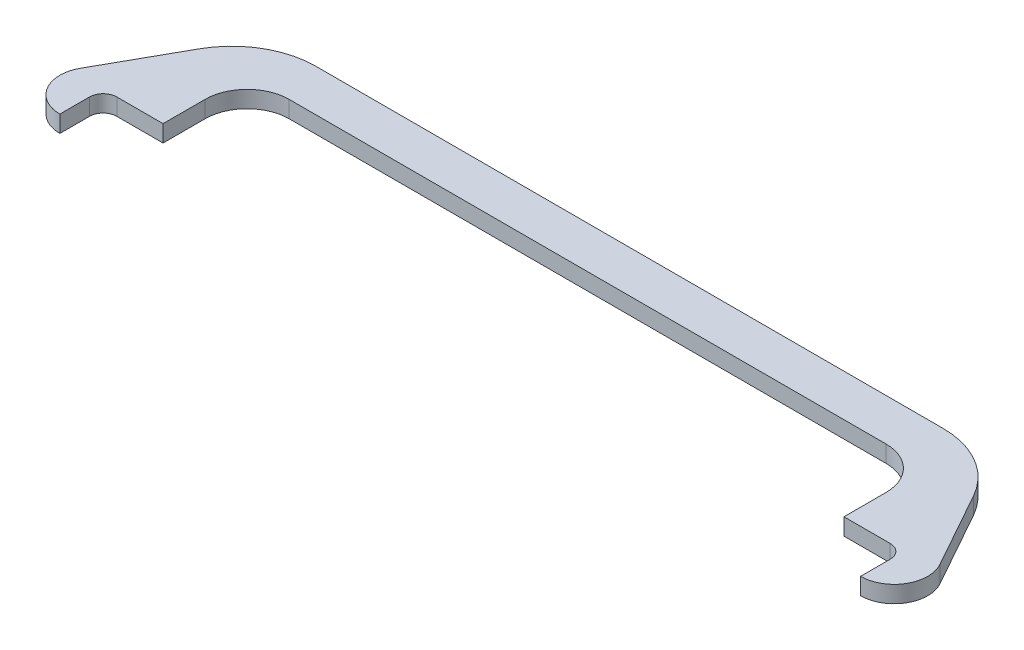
ISO-10303-21;
HEADER;
FILE_DESCRIPTION(('STEP AP214'),'2;1');
FILE_NAME('part.step','',(''),(''),'','','');
FILE_SCHEMA(('AUTOMOTIVE_DESIGN { 1 0 10303 214 1 1 1 1 }'));
ENDSEC;
DATA;
#1=APPLICATION_CONTEXT('core data for automotive mechanical design processes');
#2=APPLICATION_PROTOCOL_DEFINITION('international standard','automotive_design',2000,#1);
#3=PRODUCT_CONTEXT('',#1,'mechanical');
#4=PRODUCT('Part','Part','',(#3));
#5=PRODUCT_RELATED_PRODUCT_CATEGORY('part','',(#4));
#6=PRODUCT_DEFINITION_FORMATION('','',#4);
#7=PRODUCT_DEFINITION_CONTEXT('part definition',#1,'design');
#8=PRODUCT_DEFINITION('design','',#6,#7);
#9=PRODUCT_DEFINITION_SHAPE('','',#8);
#10=(LENGTH_UNIT() NAMED_UNIT(*) SI_UNIT(.MILLI.,.METRE.));
#11=(NAMED_UNIT(*) PLANE_ANGLE_UNIT() SI_UNIT($,.RADIAN.));
#12=(NAMED_UNIT(*) SI_UNIT($,.STERADIAN.) SOLID_ANGLE_UNIT());
#13=UNCERTAINTY_MEASURE_WITH_UNIT(LENGTH_MEASURE(1.E-05),#10,'distance_accuracy_value','');
#14=(GEOMETRIC_REPRESENTATION_CONTEXT(3) GLOBAL_UNCERTAINTY_ASSIGNED_CONTEXT((#13)) GLOBAL_UNIT_ASSIGNED_CONTEXT((#10,
#11,#12)) REPRESENTATION_CONTEXT('',''));
#15=CARTESIAN_POINT('',(0.,0.,0.));
#16=DIRECTION('',(0.,0.,1.));
#17=DIRECTION('',(1.,0.,0.));
#18=AXIS2_PLACEMENT_3D('',#15,#16,#17);
#19=CARTESIAN_POINT('',(149.257661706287,8.,20.));
#20=DIRECTION('',(0.,-1.,0.));
#21=DIRECTION('',(0.,0.,-1.));
#22=AXIS2_PLACEMENT_3D('',#19,#20,#21);
#23=CYLINDRICAL_SURFACE('',#22,40.);
#24=CARTESIAN_POINT('',(149.257661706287,0.,20.));
#25=DIRECTION('',(0.,1.,0.));
#26=DIRECTION('',(0.,0.,1.));
#27=AXIS2_PLACEMENT_3D('',#24,#25,#26);
#28=CIRCLE('',#27,40.);
#29=CARTESIAN_POINT('',(184.174544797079,0.,0.48561363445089));
#30=VERTEX_POINT('',#29);
#31=CARTESIAN_POINT('',(149.257661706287,0.,-20.));
#32=VERTEX_POINT('',#31);
#33=EDGE_CURVE('E158',#30,#32,#28,.T.);
#34=ORIENTED_EDGE('',*,*,#33,.T.);
#35=DIRECTION('',(0.,-1.,0.));
#36=VECTOR('',#35,1.);
#37=CARTESIAN_POINT('',(149.257661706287,8.,-20.));
#38=LINE('',#37,#36);
#39=CARTESIAN_POINT('',(149.257661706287,8.,-20.));
#40=VERTEX_POINT('',#39);
#41=EDGE_CURVE('E11',#40,#32,#38,.T.);
#42=ORIENTED_EDGE('',*,*,#41,.F.);
#43=CARTESIAN_POINT('',(149.257661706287,8.,20.));
#44=DIRECTION('',(0.,1.,0.));
#45=DIRECTION('',(0.,0.,1.));
#46=AXIS2_PLACEMENT_3D('',#43,#44,#45);
#47=CIRCLE('',#46,40.);
#48=CARTESIAN_POINT('',(184.174544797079,8.,0.48561363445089));
#49=VERTEX_POINT('',#48);
#50=EDGE_CURVE('E205',#49,#40,#47,.T.);
#51=ORIENTED_EDGE('',*,*,#50,.F.);
#52=DIRECTION('',(0.,-1.,0.));
#53=VECTOR('',#52,1.);
#54=CARTESIAN_POINT('',(184.174544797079,8.,0.48561363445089));
#55=LINE('',#54,#53);
#56=EDGE_CURVE('E171',#49,#30,#55,.T.);
#57=ORIENTED_EDGE('',*,*,#56,.T.);
#58=EDGE_LOOP('',(#34,#42,#51,#57));
#59=FACE_BOUND('',#58,.T.);
#60=ADVANCED_FACE('F30',(#59),#23,.T.);
#61=CARTESIAN_POINT('',(149.257661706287,8.,-20.));
#62=DIRECTION('',(0.,0.,1.));
#63=DIRECTION('',(1.,0.,0.));
#64=AXIS2_PLACEMENT_3D('',#61,#62,#63);
#65=PLANE('',#64);
#66=DIRECTION('',(-1.,0.,0.));
#67=VECTOR('',#66,1.);
#68=CARTESIAN_POINT('',(149.257661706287,0.,-20.));
#69=LINE('',#68,#67);
#70=CARTESIAN_POINT('',(-149.257661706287,0.,-20.));
#71=VERTEX_POINT('',#70);
#72=EDGE_CURVE('E154',#32,#71,#69,.T.);
#73=ORIENTED_EDGE('',*,*,#72,.T.);
#74=DIRECTION('',(0.,-1.,0.));
#75=VECTOR('',#74,1.);
#76=CARTESIAN_POINT('',(-149.257661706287,8.,-20.));
#77=LINE('',#76,#75);
#78=CARTESIAN_POINT('',(-149.257661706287,8.,-20.));
#79=VERTEX_POINT('',#78);
#80=EDGE_CURVE('E37',#79,#71,#77,.T.);
#81=ORIENTED_EDGE('',*,*,#80,.F.);
#82=DIRECTION('',(-1.,0.,0.));
#83=VECTOR('',#82,1.);
#84=CARTESIAN_POINT('',(149.257661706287,8.,-20.));
#85=LINE('',#84,#83);
#86=EDGE_CURVE('E167',#40,#79,#85,.T.);
#87=ORIENTED_EDGE('',*,*,#86,.F.);
#88=ORIENTED_EDGE('',*,*,#41,.T.);
#89=EDGE_LOOP('',(#73,#81,#87,#88));
#90=FACE_BOUND('',#89,.T.);
#91=ADVANCED_FACE('F166',(#90),#65,.F.);
#92=CARTESIAN_POINT('',(-149.257661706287,8.,20.));
#93=DIRECTION('',(0.,-1.,0.));
#94=DIRECTION('',(0.,0.,-1.));
#95=AXIS2_PLACEMENT_3D('',#92,#93,#94);
#96=CYLINDRICAL_SURFACE('',#95,40.);
#97=CARTESIAN_POINT('',(-149.257661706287,0.,20.));
#98=DIRECTION('',(0.,1.,0.));
#99=DIRECTION('',(0.,0.,-1.));
#100=AXIS2_PLACEMENT_3D('',#97,#98,#99);
#101=CIRCLE('',#100,40.);
#102=CARTESIAN_POINT('',(-184.174544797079,0.,0.48561363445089));
#103=VERTEX_POINT('',#102);
#104=EDGE_CURVE('E160',#71,#103,#101,.T.);
#105=ORIENTED_EDGE('',*,*,#104,.T.);
#106=DIRECTION('',(0.,-1.,0.));
#107=VECTOR('',#106,1.);
#108=CARTESIAN_POINT('',(-184.174544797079,8.,0.48561363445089));
#109=LINE('',#108,#107);
#110=CARTESIAN_POINT('',(-184.174544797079,8.,0.48561363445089));
#111=VERTEX_POINT('',#110);
#112=EDGE_CURVE('E281',#111,#103,#109,.T.);
#113=ORIENTED_EDGE('',*,*,#112,.F.);
#114=CARTESIAN_POINT('',(-149.257661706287,8.,20.));
#115=DIRECTION('',(0.,1.,0.));
#116=DIRECTION('',(0.,0.,-1.));
#117=AXIS2_PLACEMENT_3D('',#114,#115,#116);
#118=CIRCLE('',#117,40.);
#119=EDGE_CURVE('E208',#79,#111,#118,.T.);
#120=ORIENTED_EDGE('',*,*,#119,.F.);
#121=ORIENTED_EDGE('',*,*,#80,.T.);
#122=EDGE_LOOP('',(#105,#113,#120,#121));
#123=FACE_BOUND('',#122,.T.);
#124=ADVANCED_FACE('F285',(#123),#96,.T.);
#125=CARTESIAN_POINT('',(-204.466753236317,8.,36.7942454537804));
#126=DIRECTION('',(0.872922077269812,0.,0.487859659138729));
#127=DIRECTION('',(0.487859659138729,0.,-0.872922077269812));
#128=AXIS2_PLACEMENT_3D('',#125,#126,#127);
#129=PLANE('',#128);
#130=DIRECTION('',(-0.487859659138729,0.,0.872922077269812));
#131=VECTOR('',#130,1.);
#132=CARTESIAN_POINT('',(-204.466753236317,0.,36.7942454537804));
#133=LINE('',#132,#131);
#134=CARTESIAN_POINT('',(-204.466753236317,0.,36.7942454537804));
#135=VERTEX_POINT('',#134);
#136=EDGE_CURVE('E175',#103,#135,#133,.T.);
#137=ORIENTED_EDGE('',*,*,#136,.T.);
#138=DIRECTION('',(0.,-1.,0.));
#139=VECTOR('',#138,1.);
#140=CARTESIAN_POINT('',(-204.466753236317,8.,36.7942454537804));
#141=LINE('',#140,#139);
#142=CARTESIAN_POINT('',(-204.466753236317,8.,36.7942454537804));
#143=VERTEX_POINT('',#142);
#144=EDGE_CURVE('E278',#143,#135,#141,.T.);
#145=ORIENTED_EDGE('',*,*,#144,.F.);
#146=DIRECTION('',(-0.487859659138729,0.,0.872922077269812));
#147=VECTOR('',#146,1.);
#148=CARTESIAN_POINT('',(-204.466753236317,8.,36.7942454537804));
#149=LINE('',#148,#147);
#150=EDGE_CURVE('E210',#111,#143,#149,.T.);
#151=ORIENTED_EDGE('',*,*,#150,.F.);
#152=ORIENTED_EDGE('',*,*,#112,.T.);
#153=EDGE_LOOP('',(#137,#145,#151,#152));
#154=FACE_BOUND('',#153,.T.);
#155=ADVANCED_FACE('F293',(#154),#129,.F.);
#156=CARTESIAN_POINT('',(-190.5,8.,44.6));
#157=DIRECTION('',(0.,-1.,0.));
#158=DIRECTION('',(0.,0.,-1.));
#159=AXIS2_PLACEMENT_3D('',#156,#157,#158);
#160=CYLINDRICAL_SURFACE('',#159,16.);
#161=CARTESIAN_POINT('',(-190.5,0.,44.6));
#162=DIRECTION('',(0.,1.,0.));
#163=DIRECTION('',(0.,0.,-1.));
#164=AXIS2_PLACEMENT_3D('',#161,#162,#163);
#165=CIRCLE('',#164,16.);
#166=CARTESIAN_POINT('',(-190.5,0.,60.6));
#167=VERTEX_POINT('',#166);
#168=EDGE_CURVE('E177',#135,#167,#165,.T.);
#169=ORIENTED_EDGE('',*,*,#168,.T.);
#170=DIRECTION('',(0.,-1.,0.));
#171=VECTOR('',#170,1.);
#172=CARTESIAN_POINT('',(-190.5,8.,60.6));
#173=LINE('',#172,#171);
#174=CARTESIAN_POINT('',(-190.5,8.,60.6));
#175=VERTEX_POINT('',#174);
#176=EDGE_CURVE('E275',#175,#167,#173,.T.);
#177=ORIENTED_EDGE('',*,*,#176,.F.);
#178=CARTESIAN_POINT('',(-190.5,8.,44.6));
#179=DIRECTION('',(0.,1.,0.));
#180=DIRECTION('',(0.,0.,-1.));
#181=AXIS2_PLACEMENT_3D('',#178,#179,#180);
#182=CIRCLE('',#181,16.);
#183=EDGE_CURVE('E212',#143,#175,#182,.T.);
#184=ORIENTED_EDGE('',*,*,#183,.F.);
#185=ORIENTED_EDGE('',*,*,#144,.T.);
#186=EDGE_LOOP('',(#169,#177,#184,#185));
#187=FACE_BOUND('',#186,.T.);
#188=ADVANCED_FACE('F296',(#187),#160,.T.);
#189=CARTESIAN_POINT('',(-190.5,8.,46.5));
#190=DIRECTION('',(-1.,0.,0.));
#191=DIRECTION('',(0.,0.,1.));
#192=AXIS2_PLACEMENT_3D('',#189,#190,#191);
#193=PLANE('',#192);
#194=DIRECTION('',(0.,0.,-1.));
#195=VECTOR('',#194,1.);
#196=CARTESIAN_POINT('',(-190.5,0.,46.5));
#197=LINE('',#196,#195);
#198=CARTESIAN_POINT('',(-190.5,0.,46.5));
#199=VERTEX_POINT('',#198);
#200=EDGE_CURVE('E179',#167,#199,#197,.T.);
#201=ORIENTED_EDGE('',*,*,#200,.T.);
#202=DIRECTION('',(0.,-1.,0.));
#203=VECTOR('',#202,1.);
#204=CARTESIAN_POINT('',(-190.5,8.,46.5));
#205=LINE('',#204,#203);
#206=CARTESIAN_POINT('',(-190.5,8.,46.5));
#207=VERTEX_POINT('',#206);
#208=EDGE_CURVE('E272',#207,#199,#205,.T.);
#209=ORIENTED_EDGE('',*,*,#208,.F.);
#210=DIRECTION('',(0.,0.,-1.));
#211=VECTOR('',#210,1.);
#212=CARTESIAN_POINT('',(-190.5,8.,46.5));
#213=LINE('',#212,#211);
#214=EDGE_CURVE('E214',#175,#207,#213,.T.);
#215=ORIENTED_EDGE('',*,*,#214,.F.);
#216=ORIENTED_EDGE('',*,*,#176,.T.);
#217=EDGE_LOOP('',(#201,#209,#215,#216));
#218=FACE_BOUND('',#217,.T.);
#219=ADVANCED_FACE('F301',(#218),#193,.F.);
#220=CARTESIAN_POINT('',(-184.,8.,46.5));
#221=DIRECTION('',(0.,-1.,0.));
#222=DIRECTION('',(0.,0.,-1.));
#223=AXIS2_PLACEMENT_3D('',#220,#221,#222);
#224=CYLINDRICAL_SURFACE('',#223,6.5);
#225=CARTESIAN_POINT('',(-184.,0.,46.5));
#226=DIRECTION('',(0.,-1.,0.));
#227=DIRECTION('',(0.,0.,-1.));
#228=AXIS2_PLACEMENT_3D('',#225,#226,#227);
#229=CIRCLE('',#228,6.5);
#230=CARTESIAN_POINT('',(-184.,0.,40.));
#231=VERTEX_POINT('',#230);
#232=EDGE_CURVE('E181',#199,#231,#229,.T.);
#233=ORIENTED_EDGE('',*,*,#232,.T.);
#234=DIRECTION('',(0.,-1.,0.));
#235=VECTOR('',#234,1.);
#236=CARTESIAN_POINT('',(-184.,8.,40.));
#237=LINE('',#236,#235);
#238=CARTESIAN_POINT('',(-184.,8.,40.));
#239=VERTEX_POINT('',#238);
#240=EDGE_CURVE('E269',#239,#231,#237,.T.);
#241=ORIENTED_EDGE('',*,*,#240,.F.);
#242=CARTESIAN_POINT('',(-184.,8.,46.5));
#243=DIRECTION('',(0.,-1.,0.));
#244=DIRECTION('',(0.,0.,-1.));
#245=AXIS2_PLACEMENT_3D('',#242,#243,#244);
#246=CIRCLE('',#245,6.5);
#247=EDGE_CURVE('E216',#207,#239,#246,.T.);
#248=ORIENTED_EDGE('',*,*,#247,.F.);
#249=ORIENTED_EDGE('',*,*,#208,.T.);
#250=EDGE_LOOP('',(#233,#241,#248,#249));
#251=FACE_BOUND('',#250,.T.);
#252=ADVANCED_FACE('F307',(#251),#224,.F.);
#253=CARTESIAN_POINT('',(-162.,8.,40.));
#254=DIRECTION('',(0.,0.,-1.));
#255=DIRECTION('',(-1.,0.,0.));
#256=AXIS2_PLACEMENT_3D('',#253,#254,#255);
#257=PLANE('',#256);
#258=DIRECTION('',(1.,0.,0.));
#259=VECTOR('',#258,1.);
#260=CARTESIAN_POINT('',(-162.,0.,40.));
#261=LINE('',#260,#259);
#262=CARTESIAN_POINT('',(-162.,0.,40.));
#263=VERTEX_POINT('',#262);
#264=EDGE_CURVE('E183',#231,#263,#261,.T.);
#265=ORIENTED_EDGE('',*,*,#264,.T.);
#266=DIRECTION('',(0.,-1.,0.));
#267=VECTOR('',#266,1.);
#268=CARTESIAN_POINT('',(-162.,8.,40.));
#269=LINE('',#268,#267);
#270=CARTESIAN_POINT('',(-162.,8.,40.));
#271=VERTEX_POINT('',#270);
#272=EDGE_CURVE('E266',#271,#263,#269,.T.);
#273=ORIENTED_EDGE('',*,*,#272,.F.);
#274=DIRECTION('',(1.,0.,0.));
#275=VECTOR('',#274,1.);
#276=CARTESIAN_POINT('',(-162.,8.,40.));
#277=LINE('',#276,#275);
#278=EDGE_CURVE('E218',#239,#271,#277,.T.);
#279=ORIENTED_EDGE('',*,*,#278,.F.);
#280=ORIENTED_EDGE('',*,*,#240,.T.);
#281=EDGE_LOOP('',(#265,#273,#279,#280));
#282=FACE_BOUND('',#281,.T.);
#283=ADVANCED_FACE('F311',(#282),#257,.F.);
#284=CARTESIAN_POINT('',(-162.,8.,20.0000000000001));
#285=DIRECTION('',(-1.,0.,0.));
#286=DIRECTION('',(0.,0.,1.));
#287=AXIS2_PLACEMENT_3D('',#284,#285,#286);
#288=PLANE('',#287);
#289=DIRECTION('',(0.,0.,-1.));
#290=VECTOR('',#289,1.);
#291=CARTESIAN_POINT('',(-162.,0.,20.0000000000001));
#292=LINE('',#291,#290);
#293=CARTESIAN_POINT('',(-162.,0.,20.0000000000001));
#294=VERTEX_POINT('',#293);
#295=EDGE_CURVE('E185',#263,#294,#292,.T.);
#296=ORIENTED_EDGE('',*,*,#295,.T.);
#297=DIRECTION('',(0.,-1.,0.));
#298=VECTOR('',#297,1.);
#299=CARTESIAN_POINT('',(-162.,8.,20.0000000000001));
#300=LINE('',#299,#298);
#301=CARTESIAN_POINT('',(-162.,8.,20.0000000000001));
#302=VERTEX_POINT('',#301);
#303=EDGE_CURVE('E263',#302,#294,#300,.T.);
#304=ORIENTED_EDGE('',*,*,#303,.F.);
#305=DIRECTION('',(0.,0.,-1.));
#306=VECTOR('',#305,1.);
#307=CARTESIAN_POINT('',(-162.,8.,20.0000000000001));
#308=LINE('',#307,#306);
#309=EDGE_CURVE('E220',#271,#302,#308,.T.);
#310=ORIENTED_EDGE('',*,*,#309,.F.);
#311=ORIENTED_EDGE('',*,*,#272,.T.);
#312=EDGE_LOOP('',(#296,#304,#310,#311));
#313=FACE_BOUND('',#312,.T.);
#314=ADVANCED_FACE('F316',(#313),#288,.F.);
#315=CARTESIAN_POINT('',(-142.,8.,20.));
#316=DIRECTION('',(0.,-1.,0.));
#317=DIRECTION('',(0.,0.,-1.));
#318=AXIS2_PLACEMENT_3D('',#315,#316,#317);
#319=CYLINDRICAL_SURFACE('',#318,20.);
#320=CARTESIAN_POINT('',(-142.,0.,20.));
#321=DIRECTION('',(0.,-1.,0.));
#322=DIRECTION('',(0.,0.,-1.));
#323=AXIS2_PLACEMENT_3D('',#320,#321,#322);
#324=CIRCLE('',#323,20.);
#325=CARTESIAN_POINT('',(-142.,0.,0.));
#326=VERTEX_POINT('',#325);
#327=EDGE_CURVE('E187',#294,#326,#324,.T.);
#328=ORIENTED_EDGE('',*,*,#327,.T.);
#329=DIRECTION('',(0.,-1.,0.));
#330=VECTOR('',#329,1.);
#331=CARTESIAN_POINT('',(-142.,8.,0.));
#332=LINE('',#331,#330);
#333=CARTESIAN_POINT('',(-142.,8.,0.));
#334=VERTEX_POINT('',#333);
#335=EDGE_CURVE('E260',#334,#326,#332,.T.);
#336=ORIENTED_EDGE('',*,*,#335,.F.);
#337=CARTESIAN_POINT('',(-142.,8.,20.));
#338=DIRECTION('',(0.,-1.,0.));
#339=DIRECTION('',(0.,0.,-1.));
#340=AXIS2_PLACEMENT_3D('',#337,#338,#339);
#341=CIRCLE('',#340,20.);
#342=EDGE_CURVE('E222',#302,#334,#341,.T.);
#343=ORIENTED_EDGE('',*,*,#342,.F.);
#344=ORIENTED_EDGE('',*,*,#303,.T.);
#345=EDGE_LOOP('',(#328,#336,#343,#344));
#346=FACE_BOUND('',#345,.T.);
#347=ADVANCED_FACE('F322',(#346),#319,.F.);
#348=CARTESIAN_POINT('',(-142.,8.,0.));
#349=DIRECTION('',(0.,0.,-1.));
#350=DIRECTION('',(-1.,0.,0.));
#351=AXIS2_PLACEMENT_3D('',#348,#349,#350);
#352=PLANE('',#351);
#353=DIRECTION('',(1.,0.,0.));
#354=VECTOR('',#353,1.);
#355=CARTESIAN_POINT('',(-142.,0.,0.));
#356=LINE('',#355,#354);
#357=CARTESIAN_POINT('',(142.,0.,0.));
#358=VERTEX_POINT('',#357);
#359=EDGE_CURVE('E189',#326,#358,#356,.T.);
#360=ORIENTED_EDGE('',*,*,#359,.T.);
#361=DIRECTION('',(0.,-1.,0.));
#362=VECTOR('',#361,1.);
#363=CARTESIAN_POINT('',(142.,8.,0.));
#364=LINE('',#363,#362);
#365=CARTESIAN_POINT('',(142.,8.,0.));
#366=VERTEX_POINT('',#365);
#367=EDGE_CURVE('E257',#366,#358,#364,.T.);
#368=ORIENTED_EDGE('',*,*,#367,.F.);
#369=DIRECTION('',(1.,0.,0.));
#370=VECTOR('',#369,1.);
#371=CARTESIAN_POINT('',(-142.,8.,0.));
#372=LINE('',#371,#370);
#373=EDGE_CURVE('E224',#334,#366,#372,.T.);
#374=ORIENTED_EDGE('',*,*,#373,.F.);
#375=ORIENTED_EDGE('',*,*,#335,.T.);
#376=EDGE_LOOP('',(#360,#368,#374,#375));
#377=FACE_BOUND('',#376,.T.);
#378=ADVANCED_FACE('F326',(#377),#352,.F.);
#379=CARTESIAN_POINT('',(142.,8.,20.));
#380=DIRECTION('',(0.,-1.,0.));
#381=DIRECTION('',(0.,0.,-1.));
#382=AXIS2_PLACEMENT_3D('',#379,#380,#381);
#383=CYLINDRICAL_SURFACE('',#382,20.);
#384=CARTESIAN_POINT('',(142.,0.,20.));
#385=DIRECTION('',(0.,-1.,0.));
#386=DIRECTION('',(0.,0.,1.));
#387=AXIS2_PLACEMENT_3D('',#384,#385,#386);
#388=CIRCLE('',#387,20.);
#389=CARTESIAN_POINT('',(162.,0.,20.0000000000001));
#390=VERTEX_POINT('',#389);
#391=EDGE_CURVE('E191',#358,#390,#388,.T.);
#392=ORIENTED_EDGE('',*,*,#391,.T.);
#393=DIRECTION('',(0.,-1.,0.));
#394=VECTOR('',#393,1.);
#395=CARTESIAN_POINT('',(162.,8.,20.0000000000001));
#396=LINE('',#395,#394);
#397=CARTESIAN_POINT('',(162.,8.,20.0000000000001));
#398=VERTEX_POINT('',#397);
#399=EDGE_CURVE('E254',#398,#390,#396,.T.);
#400=ORIENTED_EDGE('',*,*,#399,.F.);
#401=CARTESIAN_POINT('',(142.,8.,20.));
#402=DIRECTION('',(0.,-1.,0.));
#403=DIRECTION('',(0.,0.,1.));
#404=AXIS2_PLACEMENT_3D('',#401,#402,#403);
#405=CIRCLE('',#404,20.);
#406=EDGE_CURVE('E226',#366,#398,#405,.T.);
#407=ORIENTED_EDGE('',*,*,#406,.F.);
#408=ORIENTED_EDGE('',*,*,#367,.T.);
#409=EDGE_LOOP('',(#392,#400,#407,#408));
#410=FACE_BOUND('',#409,.T.);
#411=ADVANCED_FACE('F331',(#410),#383,.F.);
#412=CARTESIAN_POINT('',(162.,8.,20.0000000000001));
#413=DIRECTION('',(1.,0.,0.));
#414=DIRECTION('',(0.,0.,-1.));
#415=AXIS2_PLACEMENT_3D('',#412,#413,#414);
#416=PLANE('',#415);
#417=DIRECTION('',(0.,0.,1.));
#418=VECTOR('',#417,1.);
#419=CARTESIAN_POINT('',(162.,0.,20.0000000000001));
#420=LINE('',#419,#418);
#421=CARTESIAN_POINT('',(162.,0.,40.));
#422=VERTEX_POINT('',#421);
#423=EDGE_CURVE('E193',#390,#422,#420,.T.);
#424=ORIENTED_EDGE('',*,*,#423,.T.);
#425=DIRECTION('',(0.,-1.,0.));
#426=VECTOR('',#425,1.);
#427=CARTESIAN_POINT('',(162.,8.,40.));
#428=LINE('',#427,#426);
#429=CARTESIAN_POINT('',(162.,8.,40.));
#430=VERTEX_POINT('',#429);
#431=EDGE_CURVE('E251',#430,#422,#428,.T.);
#432=ORIENTED_EDGE('',*,*,#431,.F.);
#433=DIRECTION('',(0.,0.,1.));
#434=VECTOR('',#433,1.);
#435=CARTESIAN_POINT('',(162.,8.,20.0000000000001));
#436=LINE('',#435,#434);
#437=EDGE_CURVE('E228',#398,#430,#436,.T.);
#438=ORIENTED_EDGE('',*,*,#437,.F.);
#439=ORIENTED_EDGE('',*,*,#399,.T.);
#440=EDGE_LOOP('',(#424,#432,#438,#439));
#441=FACE_BOUND('',#440,.T.);
#442=ADVANCED_FACE('F337',(#441),#416,.F.);
#443=CARTESIAN_POINT('',(162.,8.,40.));
#444=DIRECTION('',(0.,0.,-1.));
#445=DIRECTION('',(-1.,0.,0.));
#446=AXIS2_PLACEMENT_3D('',#443,#444,#445);
#447=PLANE('',#446);
#448=DIRECTION('',(1.,0.,0.));
#449=VECTOR('',#448,1.);
#450=CARTESIAN_POINT('',(162.,0.,40.));
#451=LINE('',#450,#449);
#452=CARTESIAN_POINT('',(184.,0.,40.));
#453=VERTEX_POINT('',#452);
#454=EDGE_CURVE('E195',#422,#453,#451,.T.);
#455=ORIENTED_EDGE('',*,*,#454,.T.);
#456=DIRECTION('',(0.,-1.,0.));
#457=VECTOR('',#456,1.);
#458=CARTESIAN_POINT('',(184.,8.,40.));
#459=LINE('',#458,#457);
#460=CARTESIAN_POINT('',(184.,8.,40.));
#461=VERTEX_POINT('',#460);
#462=EDGE_CURVE('E248',#461,#453,#459,.T.);
#463=ORIENTED_EDGE('',*,*,#462,.F.);
#464=DIRECTION('',(1.,0.,0.));
#465=VECTOR('',#464,1.);
#466=CARTESIAN_POINT('',(162.,8.,40.));
#467=LINE('',#466,#465);
#468=EDGE_CURVE('E230',#430,#461,#467,.T.);
#469=ORIENTED_EDGE('',*,*,#468,.F.);
#470=ORIENTED_EDGE('',*,*,#431,.T.);
#471=EDGE_LOOP('',(#455,#463,#469,#470));
#472=FACE_BOUND('',#471,.T.);
#473=ADVANCED_FACE('F341',(#472),#447,.F.);
#474=CARTESIAN_POINT('',(184.,8.,46.5));
#475=DIRECTION('',(0.,-1.,0.));
#476=DIRECTION('',(0.,0.,-1.));
#477=AXIS2_PLACEMENT_3D('',#474,#475,#476);
#478=CYLINDRICAL_SURFACE('',#477,6.5);
#479=CARTESIAN_POINT('',(184.,0.,46.5));
#480=DIRECTION('',(0.,-1.,0.));
#481=DIRECTION('',(0.,0.,1.));
#482=AXIS2_PLACEMENT_3D('',#479,#480,#481);
#483=CIRCLE('',#482,6.5);
#484=CARTESIAN_POINT('',(190.5,0.,46.5));
#485=VERTEX_POINT('',#484);
#486=EDGE_CURVE('E197',#453,#485,#483,.T.);
#487=ORIENTED_EDGE('',*,*,#486,.T.);
#488=DIRECTION('',(0.,-1.,0.));
#489=VECTOR('',#488,1.);
#490=CARTESIAN_POINT('',(190.5,8.,46.5));
#491=LINE('',#490,#489);
#492=CARTESIAN_POINT('',(190.5,8.,46.5));
#493=VERTEX_POINT('',#492);
#494=EDGE_CURVE('E245',#493,#485,#491,.T.);
#495=ORIENTED_EDGE('',*,*,#494,.F.);
#496=CARTESIAN_POINT('',(184.,8.,46.5));
#497=DIRECTION('',(0.,-1.,0.));
#498=DIRECTION('',(0.,0.,1.));
#499=AXIS2_PLACEMENT_3D('',#496,#497,#498);
#500=CIRCLE('',#499,6.5);
#501=EDGE_CURVE('E232',#461,#493,#500,.T.);
#502=ORIENTED_EDGE('',*,*,#501,.F.);
#503=ORIENTED_EDGE('',*,*,#462,.T.);
#504=EDGE_LOOP('',(#487,#495,#502,#503));
#505=FACE_BOUND('',#504,.T.);
#506=ADVANCED_FACE('F346',(#505),#478,.F.);
#507=CARTESIAN_POINT('',(190.5,8.,46.5));
#508=DIRECTION('',(1.,0.,0.));
#509=DIRECTION('',(0.,0.,-1.));
#510=AXIS2_PLACEMENT_3D('',#507,#508,#509);
#511=PLANE('',#510);
#512=DIRECTION('',(0.,0.,1.));
#513=VECTOR('',#512,1.);
#514=CARTESIAN_POINT('',(190.5,0.,46.5));
#515=LINE('',#514,#513);
#516=CARTESIAN_POINT('',(190.5,0.,60.6));
#517=VERTEX_POINT('',#516);
#518=EDGE_CURVE('E199',#485,#517,#515,.T.);
#519=ORIENTED_EDGE('',*,*,#518,.T.);
#520=DIRECTION('',(0.,-1.,0.));
#521=VECTOR('',#520,1.);
#522=CARTESIAN_POINT('',(190.5,8.,60.6));
#523=LINE('',#522,#521);
#524=CARTESIAN_POINT('',(190.5,8.,60.6));
#525=VERTEX_POINT('',#524);
#526=EDGE_CURVE('E242',#525,#517,#523,.T.);
#527=ORIENTED_EDGE('',*,*,#526,.F.);
#528=DIRECTION('',(0.,0.,1.));
#529=VECTOR('',#528,1.);
#530=CARTESIAN_POINT('',(190.5,8.,46.5));
#531=LINE('',#530,#529);
#532=EDGE_CURVE('E234',#493,#525,#531,.T.);
#533=ORIENTED_EDGE('',*,*,#532,.F.);
#534=ORIENTED_EDGE('',*,*,#494,.T.);
#535=EDGE_LOOP('',(#519,#527,#533,#534));
#536=FACE_BOUND('',#535,.T.);
#537=ADVANCED_FACE('F350',(#536),#511,.F.);
#538=CARTESIAN_POINT('',(190.5,8.,44.6));
#539=DIRECTION('',(0.,-1.,0.));
#540=DIRECTION('',(0.,0.,-1.));
#541=AXIS2_PLACEMENT_3D('',#538,#539,#540);
#542=CYLINDRICAL_SURFACE('',#541,16.);
#543=CARTESIAN_POINT('',(190.5,0.,44.6));
#544=DIRECTION('',(0.,1.,0.));
#545=DIRECTION('',(0.,0.,1.));
#546=AXIS2_PLACEMENT_3D('',#543,#544,#545);
#547=CIRCLE('',#546,16.);
#548=CARTESIAN_POINT('',(204.466753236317,0.,36.7942454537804));
#549=VERTEX_POINT('',#548);
#550=EDGE_CURVE('E201',#517,#549,#547,.T.);
#551=ORIENTED_EDGE('',*,*,#550,.T.);
#552=DIRECTION('',(0.,-1.,0.));
#553=VECTOR('',#552,1.);
#554=CARTESIAN_POINT('',(204.466753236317,8.,36.7942454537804));
#555=LINE('',#554,#553);
#556=CARTESIAN_POINT('',(204.466753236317,8.,36.7942454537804));
#557=VERTEX_POINT('',#556);
#558=EDGE_CURVE('E239',#557,#549,#555,.T.);
#559=ORIENTED_EDGE('',*,*,#558,.F.);
#560=CARTESIAN_POINT('',(190.5,8.,44.6));
#561=DIRECTION('',(0.,1.,0.));
#562=DIRECTION('',(0.,0.,1.));
#563=AXIS2_PLACEMENT_3D('',#560,#561,#562);
#564=CIRCLE('',#563,16.);
#565=EDGE_CURVE('E49',#525,#557,#564,.T.);
#566=ORIENTED_EDGE('',*,*,#565,.F.);
#567=ORIENTED_EDGE('',*,*,#526,.T.);
#568=EDGE_LOOP('',(#551,#559,#566,#567));
#569=FACE_BOUND('',#568,.T.);
#570=ADVANCED_FACE('F354',(#569),#542,.T.);
#571=CARTESIAN_POINT('',(204.466753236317,8.,36.7942454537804));
#572=DIRECTION('',(-0.872922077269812,0.,0.487859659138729));
#573=DIRECTION('',(0.487859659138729,0.,0.872922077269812));
#574=AXIS2_PLACEMENT_3D('',#571,#572,#573);
#575=PLANE('',#574);
#576=DIRECTION('',(-0.487859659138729,0.,-0.872922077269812));
#577=VECTOR('',#576,1.);
#578=CARTESIAN_POINT('',(204.466753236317,0.,36.7942454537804));
#579=LINE('',#578,#577);
#580=EDGE_CURVE('E203',#549,#30,#579,.T.);
#581=ORIENTED_EDGE('',*,*,#580,.T.);
#582=ORIENTED_EDGE('',*,*,#56,.F.);
#583=DIRECTION('',(-0.487859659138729,0.,-0.872922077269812));
#584=VECTOR('',#583,1.);
#585=CARTESIAN_POINT('',(204.466753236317,8.,36.7942454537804));
#586=LINE('',#585,#584);
#587=EDGE_CURVE('E44',#557,#49,#586,.T.);
#588=ORIENTED_EDGE('',*,*,#587,.F.);
#589=ORIENTED_EDGE('',*,*,#558,.T.);
#590=EDGE_LOOP('',(#581,#582,#588,#589));
#591=FACE_BOUND('',#590,.T.);
#592=ADVANCED_FACE('F356',(#591),#575,.F.);
#593=CARTESIAN_POINT('',(149.257661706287,8.,20.));
#594=DIRECTION('',(0.,1.,0.));
#595=DIRECTION('',(0.,0.,1.));
#596=AXIS2_PLACEMENT_3D('',#593,#594,#595);
#597=PLANE('',#596);
#598=ORIENTED_EDGE('',*,*,#50,.T.);
#599=ORIENTED_EDGE('',*,*,#86,.T.);
#600=ORIENTED_EDGE('',*,*,#119,.T.);
#601=ORIENTED_EDGE('',*,*,#150,.T.);
#602=ORIENTED_EDGE('',*,*,#183,.T.);
#603=ORIENTED_EDGE('',*,*,#214,.T.);
#604=ORIENTED_EDGE('',*,*,#247,.T.);
#605=ORIENTED_EDGE('',*,*,#278,.T.);
#606=ORIENTED_EDGE('',*,*,#309,.T.);
#607=ORIENTED_EDGE('',*,*,#342,.T.);
#608=ORIENTED_EDGE('',*,*,#373,.T.);
#609=ORIENTED_EDGE('',*,*,#406,.T.);
#610=ORIENTED_EDGE('',*,*,#437,.T.);
#611=ORIENTED_EDGE('',*,*,#468,.T.);
#612=ORIENTED_EDGE('',*,*,#501,.T.);
#613=ORIENTED_EDGE('',*,*,#532,.T.);
#614=ORIENTED_EDGE('',*,*,#565,.T.);
#615=ORIENTED_EDGE('',*,*,#587,.T.);
#616=EDGE_LOOP('',(#598,#599,#600,#601,#602,#603,#604,#605,#606,#607,#608,#609,#610,#611,#612,
#613,#614,#615));
#617=FACE_BOUND('',#616,.T.);
#618=ADVANCED_FACE('F288',(#617),#597,.T.);
#619=CARTESIAN_POINT('',(149.257661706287,0.,20.));
#620=DIRECTION('',(0.,1.,0.));
#621=DIRECTION('',(0.,0.,1.));
#622=AXIS2_PLACEMENT_3D('',#619,#620,#621);
#623=PLANE('',#622);
#624=ORIENTED_EDGE('',*,*,#33,.F.);
#625=ORIENTED_EDGE('',*,*,#580,.F.);
#626=ORIENTED_EDGE('',*,*,#550,.F.);
#627=ORIENTED_EDGE('',*,*,#518,.F.);
#628=ORIENTED_EDGE('',*,*,#486,.F.);
#629=ORIENTED_EDGE('',*,*,#454,.F.);
#630=ORIENTED_EDGE('',*,*,#423,.F.);
#631=ORIENTED_EDGE('',*,*,#391,.F.);
#632=ORIENTED_EDGE('',*,*,#359,.F.);
#633=ORIENTED_EDGE('',*,*,#327,.F.);
#634=ORIENTED_EDGE('',*,*,#295,.F.);
#635=ORIENTED_EDGE('',*,*,#264,.F.);
#636=ORIENTED_EDGE('',*,*,#232,.F.);
#637=ORIENTED_EDGE('',*,*,#200,.F.);
#638=ORIENTED_EDGE('',*,*,#168,.F.);
#639=ORIENTED_EDGE('',*,*,#136,.F.);
#640=ORIENTED_EDGE('',*,*,#104,.F.);
#641=ORIENTED_EDGE('',*,*,#72,.F.);
#642=EDGE_LOOP('',(#624,#625,#626,#627,#628,#629,#630,#631,#632,#633,#634,#635,#636,#637,#638,
#639,#640,#641));
#643=FACE_BOUND('',#642,.T.);
#644=ADVANCED_FACE('F155',(#643),#623,.F.);
#645=CLOSED_SHELL('',(#60,#91,#124,#155,#188,#219,#252,#283,#314,#347,#378,#411,#442,#473,#506,
#537,#570,#592,#618,#644));
#646=MANIFOLD_SOLID_BREP('B2',#645);
#647=ADVANCED_BREP_SHAPE_REPRESENTATION('',(#18,#646),#14);
#648=SHAPE_DEFINITION_REPRESENTATION(#9,#647);
ENDSEC;
END-ISO-10303-21;
